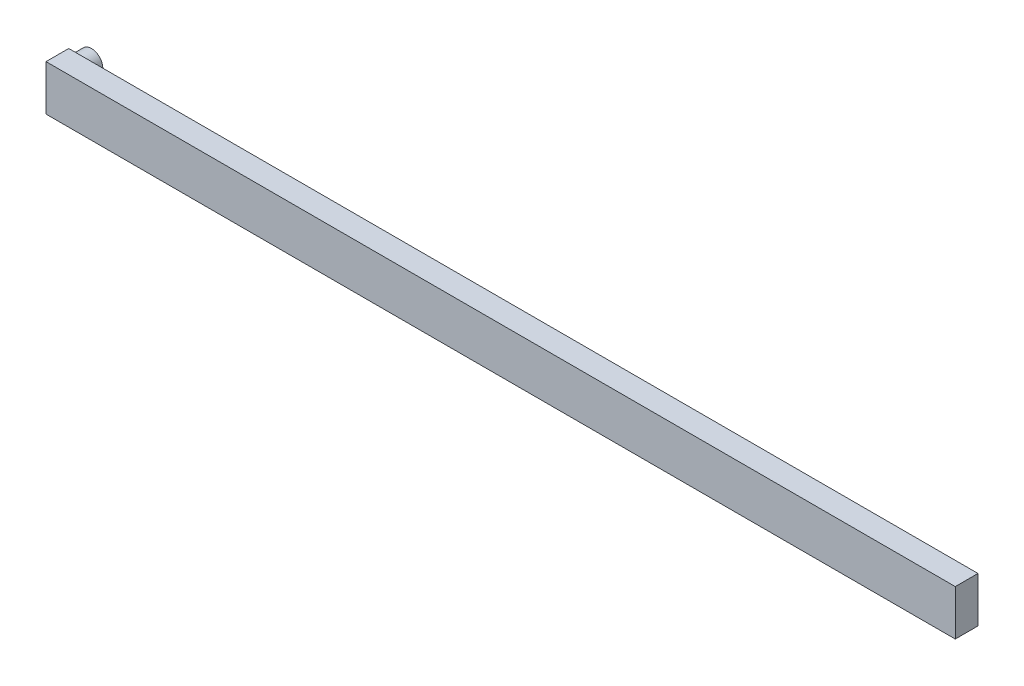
ISO-10303-21;
HEADER;
FILE_DESCRIPTION(('STEP AP214'),'2;1');
FILE_NAME('part.step','',(''),(''),'','','');
FILE_SCHEMA(('AUTOMOTIVE_DESIGN { 1 0 10303 214 1 1 1 1 }'));
ENDSEC;
DATA;
#1=APPLICATION_CONTEXT('core data for automotive mechanical design processes');
#2=APPLICATION_PROTOCOL_DEFINITION('international standard','automotive_design',2000,#1);
#3=PRODUCT_CONTEXT('',#1,'mechanical');
#4=PRODUCT('Part','Part','',(#3));
#5=PRODUCT_RELATED_PRODUCT_CATEGORY('part','',(#4));
#6=PRODUCT_DEFINITION_FORMATION('','',#4);
#7=PRODUCT_DEFINITION_CONTEXT('part definition',#1,'design');
#8=PRODUCT_DEFINITION('design','',#6,#7);
#9=PRODUCT_DEFINITION_SHAPE('','',#8);
#10=(LENGTH_UNIT() NAMED_UNIT(*) SI_UNIT(.MILLI.,.METRE.));
#11=(NAMED_UNIT(*) PLANE_ANGLE_UNIT() SI_UNIT($,.RADIAN.));
#12=(NAMED_UNIT(*) SI_UNIT($,.STERADIAN.) SOLID_ANGLE_UNIT());
#13=UNCERTAINTY_MEASURE_WITH_UNIT(LENGTH_MEASURE(1.E-05),#10,'distance_accuracy_value','');
#14=(GEOMETRIC_REPRESENTATION_CONTEXT(3) GLOBAL_UNCERTAINTY_ASSIGNED_CONTEXT((#13)) GLOBAL_UNIT_ASSIGNED_CONTEXT((#10,
#11,#12)) REPRESENTATION_CONTEXT('',''));
#15=CARTESIAN_POINT('',(0.,0.,0.));
#16=DIRECTION('',(0.,0.,1.));
#17=DIRECTION('',(1.,0.,0.));
#18=AXIS2_PLACEMENT_3D('',#15,#16,#17);
#19=CARTESIAN_POINT('',(0.,0.,-10.));
#20=DIRECTION('',(0.,0.,1.));
#21=DIRECTION('',(1.,0.,0.));
#22=AXIS2_PLACEMENT_3D('',#19,#20,#21);
#23=PLANE('',#22);
#24=CARTESIAN_POINT('',(-400.,0.,-10.));
#25=DIRECTION('',(0.,0.,-1.));
#26=DIRECTION('',(-1.,0.,0.));
#27=AXIS2_PLACEMENT_3D('',#24,#25,#26);
#28=CIRCLE('',#27,10.);
#29=CARTESIAN_POINT('',(-400.,10.,-10.));
#30=VERTEX_POINT('',#29);
#31=CARTESIAN_POINT('',(-400.,-10.,-10.));
#32=VERTEX_POINT('',#31);
#33=EDGE_CURVE('E49',#30,#32,#28,.T.);
#34=ORIENTED_EDGE('',*,*,#33,.F.);
#35=DIRECTION('',(0.,-1.,0.));
#36=VECTOR('',#35,1.);
#37=CARTESIAN_POINT('',(-400.,20.,-10.));
#38=LINE('',#37,#36);
#39=CARTESIAN_POINT('',(-400.,20.,-10.));
#40=VERTEX_POINT('',#39);
#41=EDGE_CURVE('E85',#40,#30,#38,.T.);
#42=ORIENTED_EDGE('',*,*,#41,.F.);
#43=DIRECTION('',(-1.,0.,0.));
#44=VECTOR('',#43,1.);
#45=CARTESIAN_POINT('',(-400.,20.,-10.));
#46=LINE('',#45,#44);
#47=CARTESIAN_POINT('',(400.,20.,-10.));
#48=VERTEX_POINT('',#47);
#49=EDGE_CURVE('E93',#48,#40,#46,.T.);
#50=ORIENTED_EDGE('',*,*,#49,.F.);
#51=DIRECTION('',(0.,1.,0.));
#52=VECTOR('',#51,1.);
#53=CARTESIAN_POINT('',(400.,20.,-10.));
#54=LINE('',#53,#52);
#55=CARTESIAN_POINT('',(400.,-20.,-10.));
#56=VERTEX_POINT('',#55);
#57=EDGE_CURVE('E115',#56,#48,#54,.T.);
#58=ORIENTED_EDGE('',*,*,#57,.F.);
#59=DIRECTION('',(1.,0.,0.));
#60=VECTOR('',#59,1.);
#61=CARTESIAN_POINT('',(-400.,-20.,-10.));
#62=LINE('',#61,#60);
#63=CARTESIAN_POINT('',(-400.,-20.,-10.));
#64=VERTEX_POINT('',#63);
#65=EDGE_CURVE('E92',#64,#56,#62,.T.);
#66=ORIENTED_EDGE('',*,*,#65,.F.);
#67=EDGE_CURVE('E83',#32,#64,#38,.T.);
#68=ORIENTED_EDGE('',*,*,#67,.F.);
#69=EDGE_LOOP('',(#34,#42,#50,#58,#66,#68));
#70=FACE_BOUND('',#69,.T.);
#71=ADVANCED_FACE('F32',(#70),#23,.F.);
#72=CARTESIAN_POINT('',(400.,20.,-10.));
#73=DIRECTION('',(1.,0.,0.));
#74=DIRECTION('',(0.,0.,-1.));
#75=AXIS2_PLACEMENT_3D('',#72,#73,#74);
#76=PLANE('',#75);
#77=DIRECTION('',(0.,0.,1.));
#78=VECTOR('',#77,1.);
#79=CARTESIAN_POINT('',(400.,20.,-10.));
#80=LINE('',#79,#78);
#81=CARTESIAN_POINT('',(400.,20.,10.));
#82=VERTEX_POINT('',#81);
#83=EDGE_CURVE('E36',#48,#82,#80,.T.);
#84=ORIENTED_EDGE('',*,*,#83,.T.);
#85=DIRECTION('',(0.,1.,0.));
#86=VECTOR('',#85,1.);
#87=CARTESIAN_POINT('',(400.,20.,10.));
#88=LINE('',#87,#86);
#89=CARTESIAN_POINT('',(400.,-20.,10.));
#90=VERTEX_POINT('',#89);
#91=EDGE_CURVE('E101',#90,#82,#88,.T.);
#92=ORIENTED_EDGE('',*,*,#91,.F.);
#93=DIRECTION('',(0.,0.,1.));
#94=VECTOR('',#93,1.);
#95=CARTESIAN_POINT('',(400.,-20.,-10.));
#96=LINE('',#95,#94);
#97=EDGE_CURVE('E11',#56,#90,#96,.T.);
#98=ORIENTED_EDGE('',*,*,#97,.F.);
#99=ORIENTED_EDGE('',*,*,#57,.T.);
#100=EDGE_LOOP('',(#84,#92,#98,#99));
#101=FACE_BOUND('',#100,.T.);
#102=ADVANCED_FACE('F34',(#101),#76,.T.);
#103=CARTESIAN_POINT('',(-400.,-20.,-10.));
#104=DIRECTION('',(0.,-1.,0.));
#105=DIRECTION('',(0.,0.,-1.));
#106=AXIS2_PLACEMENT_3D('',#103,#104,#105);
#107=PLANE('',#106);
#108=ORIENTED_EDGE('',*,*,#97,.T.);
#109=DIRECTION('',(1.,0.,0.));
#110=VECTOR('',#109,1.);
#111=CARTESIAN_POINT('',(-400.,-20.,10.));
#112=LINE('',#111,#110);
#113=CARTESIAN_POINT('',(-400.,-20.,10.));
#114=VERTEX_POINT('',#113);
#115=EDGE_CURVE('E112',#114,#90,#112,.T.);
#116=ORIENTED_EDGE('',*,*,#115,.F.);
#117=DIRECTION('',(0.,0.,1.));
#118=VECTOR('',#117,1.);
#119=CARTESIAN_POINT('',(-400.,-20.,-10.));
#120=LINE('',#119,#118);
#121=EDGE_CURVE('E41',#64,#114,#120,.T.);
#122=ORIENTED_EDGE('',*,*,#121,.F.);
#123=ORIENTED_EDGE('',*,*,#65,.T.);
#124=EDGE_LOOP('',(#108,#116,#122,#123));
#125=FACE_BOUND('',#124,.T.);
#126=ADVANCED_FACE('F130',(#125),#107,.T.);
#127=CARTESIAN_POINT('',(-400.,20.,-10.));
#128=DIRECTION('',(-1.,0.,0.));
#129=DIRECTION('',(0.,0.,1.));
#130=AXIS2_PLACEMENT_3D('',#127,#128,#129);
#131=PLANE('',#130);
#132=ORIENTED_EDGE('',*,*,#121,.T.);
#133=DIRECTION('',(0.,-1.,0.));
#134=VECTOR('',#133,1.);
#135=CARTESIAN_POINT('',(-400.,20.,10.));
#136=LINE('',#135,#134);
#137=CARTESIAN_POINT('',(-400.,20.,10.));
#138=VERTEX_POINT('',#137);
#139=EDGE_CURVE('E109',#138,#114,#136,.T.);
#140=ORIENTED_EDGE('',*,*,#139,.F.);
#141=DIRECTION('',(0.,0.,1.));
#142=VECTOR('',#141,1.);
#143=CARTESIAN_POINT('',(-400.,20.,-10.));
#144=LINE('',#143,#142);
#145=EDGE_CURVE('E120',#40,#138,#144,.T.);
#146=ORIENTED_EDGE('',*,*,#145,.F.);
#147=ORIENTED_EDGE('',*,*,#41,.T.);
#148=EDGE_CURVE('E81',#30,#32,#38,.T.);
#149=ORIENTED_EDGE('',*,*,#148,.T.);
#150=ORIENTED_EDGE('',*,*,#67,.T.);
#151=EDGE_LOOP('',(#132,#140,#146,#147,#149,#150));
#152=FACE_BOUND('',#151,.T.);
#153=ADVANCED_FACE('F82',(#152),#131,.T.);
#154=CARTESIAN_POINT('',(-400.,20.,-10.));
#155=DIRECTION('',(0.,1.,0.));
#156=DIRECTION('',(0.,0.,1.));
#157=AXIS2_PLACEMENT_3D('',#154,#155,#156);
#158=PLANE('',#157);
#159=ORIENTED_EDGE('',*,*,#145,.T.);
#160=DIRECTION('',(-1.,0.,0.));
#161=VECTOR('',#160,1.);
#162=CARTESIAN_POINT('',(-400.,20.,10.));
#163=LINE('',#162,#161);
#164=EDGE_CURVE('E106',#82,#138,#163,.T.);
#165=ORIENTED_EDGE('',*,*,#164,.F.);
#166=ORIENTED_EDGE('',*,*,#83,.F.);
#167=ORIENTED_EDGE('',*,*,#49,.T.);
#168=EDGE_LOOP('',(#159,#165,#166,#167));
#169=FACE_BOUND('',#168,.T.);
#170=ADVANCED_FACE('F124',(#169),#158,.T.);
#171=CARTESIAN_POINT('',(0.,0.,10.));
#172=DIRECTION('',(0.,0.,1.));
#173=DIRECTION('',(1.,0.,0.));
#174=AXIS2_PLACEMENT_3D('',#171,#172,#173);
#175=PLANE('',#174);
#176=ORIENTED_EDGE('',*,*,#91,.T.);
#177=ORIENTED_EDGE('',*,*,#164,.T.);
#178=ORIENTED_EDGE('',*,*,#139,.T.);
#179=ORIENTED_EDGE('',*,*,#115,.T.);
#180=EDGE_LOOP('',(#176,#177,#178,#179));
#181=FACE_BOUND('',#180,.T.);
#182=ADVANCED_FACE('F127',(#181),#175,.T.);
#183=CARTESIAN_POINT('',(-400.,0.,-30.));
#184=DIRECTION('',(0.,0.,1.));
#185=DIRECTION('',(1.,0.,0.));
#186=AXIS2_PLACEMENT_3D('',#183,#184,#185);
#187=CYLINDRICAL_SURFACE('',#186,10.);
#188=CARTESIAN_POINT('',(-400.,0.,-30.));
#189=DIRECTION('',(0.,0.,-1.));
#190=DIRECTION('',(-1.,0.,0.));
#191=AXIS2_PLACEMENT_3D('',#188,#189,#190);
#192=CIRCLE('',#191,10.);
#193=CARTESIAN_POINT('',(-410.,0.,-30.));
#194=VERTEX_POINT('',#193);
#195=EDGE_CURVE('E99',#194,#194,#192,.T.);
#196=ORIENTED_EDGE('',*,*,#195,.F.);
#197=EDGE_LOOP('',(#196));
#198=FACE_BOUND('',#197,.T.);
#199=ORIENTED_EDGE('',*,*,#33,.T.);
#200=EDGE_CURVE('E94',#32,#30,#28,.T.);
#201=ORIENTED_EDGE('',*,*,#200,.T.);
#202=EDGE_LOOP('',(#199,#201));
#203=FACE_BOUND('',#202,.T.);
#204=ADVANCED_FACE('F98',(#198,#203),#187,.T.);
#205=CARTESIAN_POINT('',(-400.,0.,-30.));
#206=DIRECTION('',(0.,0.,-1.));
#207=DIRECTION('',(-1.,0.,0.));
#208=AXIS2_PLACEMENT_3D('',#205,#206,#207);
#209=PLANE('',#208);
#210=ORIENTED_EDGE('',*,*,#195,.T.);
#211=EDGE_LOOP('',(#210));
#212=FACE_BOUND('',#211,.T.);
#213=ADVANCED_FACE('F147',(#212),#209,.T.);
#214=CARTESIAN_POINT('',(-400.,0.,-10.));
#215=DIRECTION('',(0.,0.,-1.));
#216=DIRECTION('',(-1.,0.,0.));
#217=AXIS2_PLACEMENT_3D('',#214,#215,#216);
#218=PLANE('',#217);
#219=ORIENTED_EDGE('',*,*,#148,.F.);
#220=ORIENTED_EDGE('',*,*,#200,.F.);
#221=EDGE_LOOP('',(#219,#220));
#222=FACE_BOUND('',#221,.T.);
#223=ADVANCED_FACE('F95',(#222),#218,.F.);
#224=CLOSED_SHELL('',(#71,#102,#126,#153,#170,#182,#204,#213,#223));
#225=MANIFOLD_SOLID_BREP('B2',#224);
#226=ADVANCED_BREP_SHAPE_REPRESENTATION('',(#18,#225),#14);
#227=SHAPE_DEFINITION_REPRESENTATION(#9,#226);
ENDSEC;
END-ISO-10303-21;
